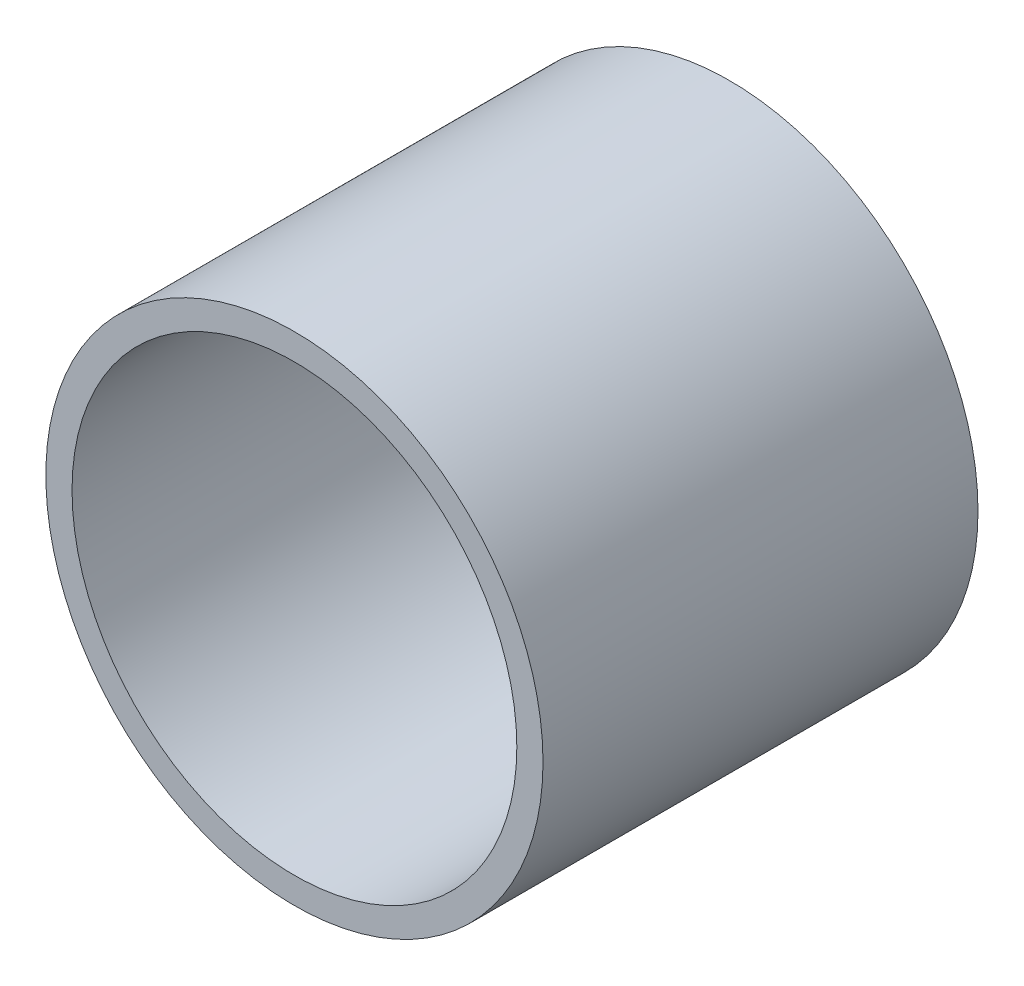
ISO-10303-21;
HEADER;
FILE_DESCRIPTION(('STEP AP214'),'2;1');
FILE_NAME('part.step','',(''),(''),'','','');
FILE_SCHEMA(('AUTOMOTIVE_DESIGN { 1 0 10303 214 1 1 1 1 }'));
ENDSEC;
DATA;
#1=APPLICATION_CONTEXT('core data for automotive mechanical design processes');
#2=APPLICATION_PROTOCOL_DEFINITION('international standard','automotive_design',2000,#1);
#3=PRODUCT_CONTEXT('',#1,'mechanical');
#4=PRODUCT('Part','Part','',(#3));
#5=PRODUCT_RELATED_PRODUCT_CATEGORY('part','',(#4));
#6=PRODUCT_DEFINITION_FORMATION('','',#4);
#7=PRODUCT_DEFINITION_CONTEXT('part definition',#1,'design');
#8=PRODUCT_DEFINITION('design','',#6,#7);
#9=PRODUCT_DEFINITION_SHAPE('','',#8);
#10=(LENGTH_UNIT() NAMED_UNIT(*) SI_UNIT(.MILLI.,.METRE.));
#11=(NAMED_UNIT(*) PLANE_ANGLE_UNIT() SI_UNIT($,.RADIAN.));
#12=(NAMED_UNIT(*) SI_UNIT($,.STERADIAN.) SOLID_ANGLE_UNIT());
#13=UNCERTAINTY_MEASURE_WITH_UNIT(LENGTH_MEASURE(1.E-05),#10,'distance_accuracy_value','');
#14=(GEOMETRIC_REPRESENTATION_CONTEXT(3) GLOBAL_UNCERTAINTY_ASSIGNED_CONTEXT((#13)) GLOBAL_UNIT_ASSIGNED_CONTEXT((#10,
#11,#12)) REPRESENTATION_CONTEXT('',''));
#15=CARTESIAN_POINT('',(0.,0.,0.));
#16=DIRECTION('',(0.,0.,1.));
#17=DIRECTION('',(1.,0.,0.));
#18=AXIS2_PLACEMENT_3D('',#15,#16,#17);
#19=CARTESIAN_POINT('',(0.,0.,100.));
#20=DIRECTION('',(0.,0.,1.));
#21=DIRECTION('',(1.,0.,0.));
#22=AXIS2_PLACEMENT_3D('',#19,#20,#21);
#23=PLANE('',#22);
#24=CARTESIAN_POINT('',(0.,0.,100.));
#25=DIRECTION('',(0.,0.,1.));
#26=DIRECTION('',(1.,0.,0.));
#27=AXIS2_PLACEMENT_3D('',#24,#25,#26);
#28=CIRCLE('',#27,57.15);
#29=CARTESIAN_POINT('',(57.15,0.,100.));
#30=VERTEX_POINT('',#29);
#31=EDGE_CURVE('E10',#30,#30,#28,.T.);
#32=ORIENTED_EDGE('',*,*,#31,.T.);
#33=EDGE_LOOP('',(#32));
#34=FACE_BOUND('',#33,.T.);
#35=CARTESIAN_POINT('',(0.,0.,100.));
#36=DIRECTION('',(0.,0.,1.));
#37=DIRECTION('',(1.,0.,0.));
#38=AXIS2_PLACEMENT_3D('',#35,#36,#37);
#39=CIRCLE('',#38,51.1302);
#40=CARTESIAN_POINT('',(51.1302,0.,100.));
#41=VERTEX_POINT('',#40);
#42=EDGE_CURVE('E41',#41,#41,#39,.T.);
#43=ORIENTED_EDGE('',*,*,#42,.F.);
#44=EDGE_LOOP('',(#43));
#45=FACE_BOUND('',#44,.T.);
#46=ADVANCED_FACE('F30',(#34,#45),#23,.T.);
#47=CARTESIAN_POINT('',(0.,0.,0.));
#48=DIRECTION('',(0.,0.,1.));
#49=DIRECTION('',(1.,0.,0.));
#50=AXIS2_PLACEMENT_3D('',#47,#48,#49);
#51=PLANE('',#50);
#52=CARTESIAN_POINT('',(0.,0.,0.));
#53=DIRECTION('',(0.,0.,1.));
#54=DIRECTION('',(1.,0.,0.));
#55=AXIS2_PLACEMENT_3D('',#52,#53,#54);
#56=CIRCLE('',#55,57.15);
#57=CARTESIAN_POINT('',(57.15,0.,0.));
#58=VERTEX_POINT('',#57);
#59=EDGE_CURVE('E34',#58,#58,#56,.T.);
#60=ORIENTED_EDGE('',*,*,#59,.F.);
#61=EDGE_LOOP('',(#60));
#62=FACE_BOUND('',#61,.T.);
#63=CARTESIAN_POINT('',(0.,0.,0.));
#64=DIRECTION('',(0.,0.,1.));
#65=DIRECTION('',(1.,0.,0.));
#66=AXIS2_PLACEMENT_3D('',#63,#64,#65);
#67=CIRCLE('',#66,51.1302);
#68=CARTESIAN_POINT('',(51.1302,0.,0.));
#69=VERTEX_POINT('',#68);
#70=EDGE_CURVE('E43',#69,#69,#67,.T.);
#71=ORIENTED_EDGE('',*,*,#70,.T.);
#72=EDGE_LOOP('',(#71));
#73=FACE_BOUND('',#72,.T.);
#74=ADVANCED_FACE('F53',(#62,#73),#51,.F.);
#75=CARTESIAN_POINT('',(0.,0.,100.));
#76=DIRECTION('',(0.,0.,-1.));
#77=DIRECTION('',(-1.,0.,0.));
#78=AXIS2_PLACEMENT_3D('',#75,#76,#77);
#79=CYLINDRICAL_SURFACE('',#78,57.15);
#80=ORIENTED_EDGE('',*,*,#31,.F.);
#81=EDGE_LOOP('',(#80));
#82=FACE_BOUND('',#81,.T.);
#83=ORIENTED_EDGE('',*,*,#59,.T.);
#84=EDGE_LOOP('',(#83));
#85=FACE_BOUND('',#84,.T.);
#86=ADVANCED_FACE('F32',(#82,#85),#79,.T.);
#87=CARTESIAN_POINT('',(0.,0.,100.));
#88=DIRECTION('',(0.,0.,-1.));
#89=DIRECTION('',(-1.,0.,0.));
#90=AXIS2_PLACEMENT_3D('',#87,#88,#89);
#91=CYLINDRICAL_SURFACE('',#90,51.1302);
#92=ORIENTED_EDGE('',*,*,#42,.T.);
#93=EDGE_LOOP('',(#92));
#94=FACE_BOUND('',#93,.T.);
#95=ORIENTED_EDGE('',*,*,#70,.F.);
#96=EDGE_LOOP('',(#95));
#97=FACE_BOUND('',#96,.T.);
#98=ADVANCED_FACE('F49',(#94,#97),#91,.F.);
#99=CLOSED_SHELL('',(#46,#74,#86,#98));
#100=MANIFOLD_SOLID_BREP('B2',#99);
#101=ADVANCED_BREP_SHAPE_REPRESENTATION('',(#18,#100),#14);
#102=SHAPE_DEFINITION_REPRESENTATION(#9,#101);
ENDSEC;
END-ISO-10303-21;
